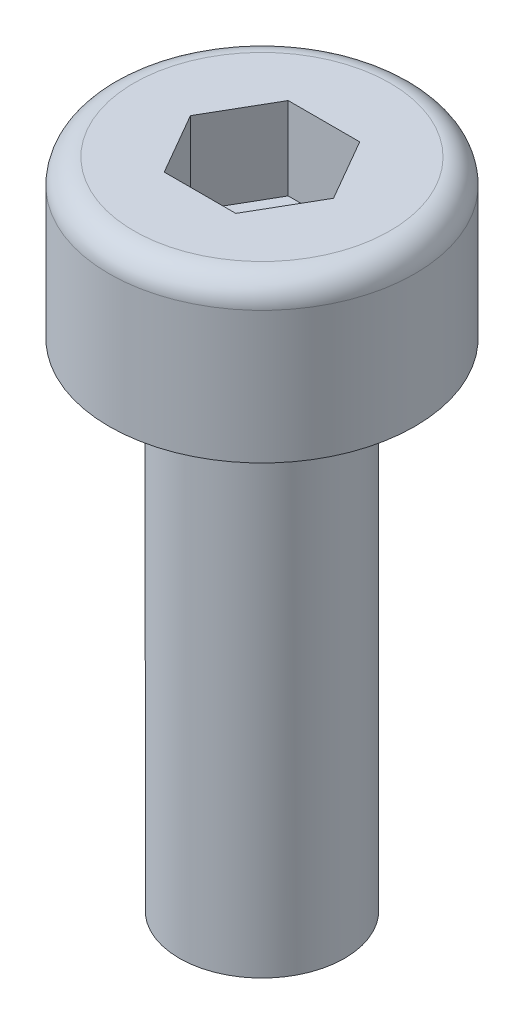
from build123d import *

# Parameters (mm, degrees)
CUT_EXTRUDE1_DEPTH = 1


with BuildPart() as part:
    # Sketch1 → Base-Revolve (revolve)
    with BuildSketch(Plane.XY, mode=Mode.PRIVATE) as base_revolve_sk:
        with BuildLine():
            Line((0, -6.267949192), (0, 1.9))
            Line((0, 1.9), (1.55, 1.9))
            ThreePointArc((1.55, 1.9), (1.762132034, 1.812132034), (1.85, 1.6))
            Line((1.85, 1.6), (1.85, 0))
            Line((1.85, 0), (1, 0))
            Line((1, 0), (1, -6))
            Line((1, -6), (0, -6.267949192))
        make_face()
    revolve(base_revolve_sk.sketch.rotate(Axis((0, 1.9, 0), (0, 1, 0)), 90), axis=Axis((0, 1.9, 0), (0, 1, 0)))

    # Sketch2 → Cut-Extrude1 (cut)
    with BuildSketch(Plane(origin=(0, 1.9, 0), x_dir=(-1, 0, 0), z_dir=(0, 1, 0))):
        Polygon((-0.866025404, 0), (-0.433012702, -0.75), (0.433012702, -0.75), (0.866025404, 0), (0.433012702, 0.75), (-0.433012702, 0.75), align=None)
    extrude(amount=-CUT_EXTRUDE1_DEPTH, mode=Mode.SUBTRACT)


solid = part.part
